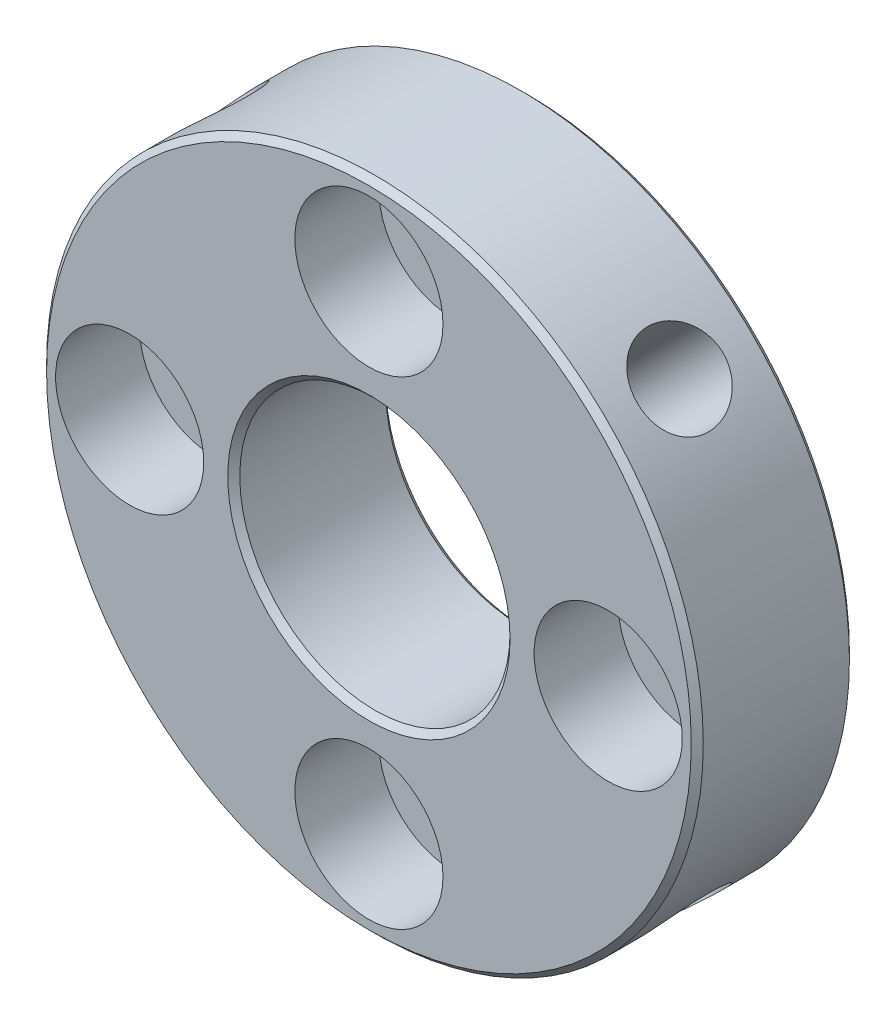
from build123d import *

# Parameters (mm, degrees)
SCHIZZO1_R                  = 16.4
ESTRUSIONE1_DEPTH           = 7.9
TAGLIO_ESTRUSIONE1_REACH    = 26.502
SCHIZZO2_R                  = 6.75
SMUSSO1_SIZE                = 0.3
SCHIZZO5_R                  = 3.7
TAGLIO_ESTRUSIONE2_DEPTH    = 4.2
TAGLIO_ESTRUSIONE3_REACH    = 25.57
SCHIZZO7_R                  = 2.15
RIPETIZIONECIRCOLARE1_COUNT = 4
SCHIZZO12_R                 = 2.15
TAGLIO_ESTRUSIONE4_DEPTH    = 8.6
RIPETIZIONECIRCOLARE2_COUNT = 4


with BuildPart() as part:
    # Schizzo1 → Estrusione1 (new body)
    with BuildSketch(Plane.XY):
        Circle(SCHIZZO1_R)
    extrude(amount=-ESTRUSIONE1_DEPTH)

    # Schizzo2 → Taglio-Estrusione1 (cut, up to next)
    with BuildSketch(Plane.XY, mode=Mode.PRIVATE) as taglio_estrusione1_sk1:
        Circle(SCHIZZO2_R)
    taglio_estrusione1_tool1 = extrude(taglio_estrusione1_sk1.sketch, amount=-TAGLIO_ESTRUSIONE1_REACH, mode=Mode.PRIVATE) & part.part
    add(taglio_estrusione1_tool1.solids().sort_by_distance((0, 0, 0))[0], mode=Mode.SUBTRACT)

    # Smusso1
    smusso1_edges = [part.edges().sort_by_distance(p)[0] for p in [
        (-16.4, 0, 0),
        (-16.4, 0, -7.9),
        (-6.75, 0, 0),
        (-6.75, 0, -7.9),
    ]]
    chamfer(smusso1_edges, length=SMUSSO1_SIZE)

    # Schizzo5 → Taglio-Estrusione2 (cut)
    with BuildSketch(Plane.XY):
        with Locations((0, 11.95)):
            Circle(SCHIZZO5_R)
    taglio_estrusione2 = extrude(amount=-TAGLIO_ESTRUSIONE2_DEPTH, mode=Mode.SUBTRACT)

    # Schizzo7 → Taglio-Estrusione3 (cut, up to next)
    with BuildSketch(Plane.XY.offset(-4.2), mode=Mode.PRIVATE) as taglio_estrusione3_sk1:
        with Locations((0, 11.95)):
            Circle(SCHIZZO7_R)
    taglio_estrusione3_tool1 = extrude(taglio_estrusione3_sk1.sketch, amount=-TAGLIO_ESTRUSIONE3_REACH, mode=Mode.PRIVATE) & part.part
    taglio_estrusione3 = taglio_estrusione3_tool1.solids().sort_by_distance((0, 11.95, -4.2))[0]
    add(taglio_estrusione3, mode=Mode.SUBTRACT)

    # RipetizioneCircolare1: Taglio-Estrusione2, Taglio-Estrusione3 ×4 about axis
    ripetizionecircolare1_axis = Axis((0, 0, 0), (0, 0, 1))
    add([taglio_estrusione2.rotate(ripetizionecircolare1_axis, i * 360 / RIPETIZIONECIRCOLARE1_COUNT) for i in range(1, RIPETIZIONECIRCOLARE1_COUNT)], mode=Mode.SUBTRACT)
    add([taglio_estrusione3.rotate(ripetizionecircolare1_axis, i * 360 / RIPETIZIONECIRCOLARE1_COUNT) for i in range(1, RIPETIZIONECIRCOLARE1_COUNT)], mode=Mode.SUBTRACT)

    # Schizzo12 → Taglio-Estrusione4 (cut)
    with BuildSketch(Plane(origin=(-11.596551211, 11.596551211, 0), x_dir=(0, 0, 1), z_dir=(-0.7071067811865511, 0.7071067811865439, 0))):
        with Locations(Location((-3.95, 0, 0), (0, 0, 270))):
            Circle(SCHIZZO12_R)
    taglio_estrusione4 = extrude(amount=-TAGLIO_ESTRUSIONE4_DEPTH, mode=Mode.SUBTRACT)

    # RipetizioneCircolare2: Taglio-Estrusione4 ×4 about axis
    ripetizionecircolare2_axis = Axis((0, 0, 0), (0, 0, 1))
    for i in range(1, RIPETIZIONECIRCOLARE2_COUNT):
        add(taglio_estrusione4.rotate(ripetizionecircolare2_axis, i * 360 / RIPETIZIONECIRCOLARE2_COUNT), mode=Mode.SUBTRACT)


solid = part.part
